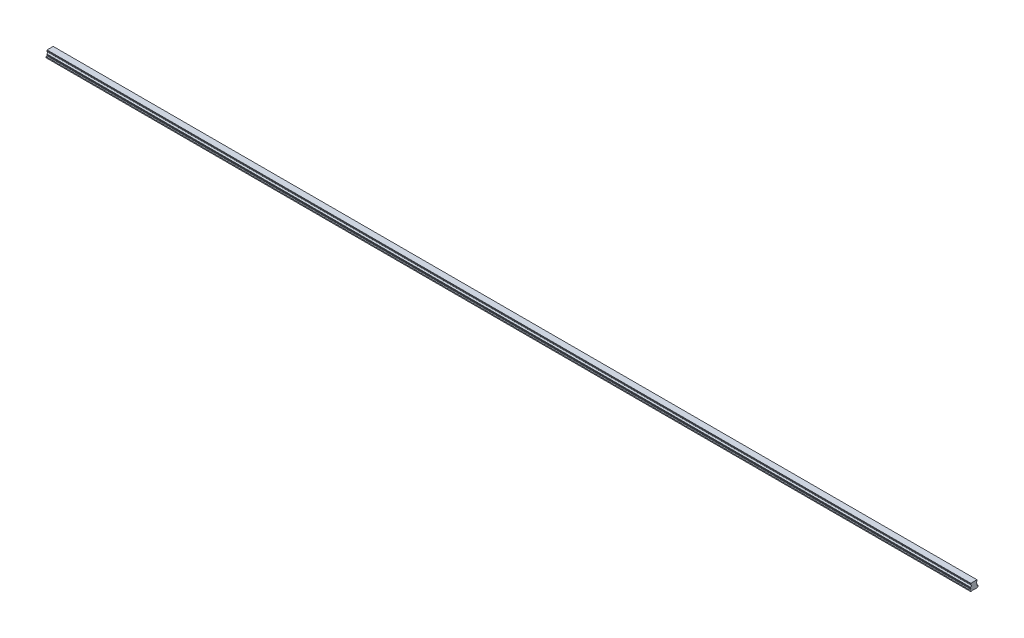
from build123d import *

# Parameters (mm, degrees)
BOSS_EXTRUDE1_DEPTH        = 2820
SKETCH3_R                  = 3
SKETCH3_R_2                = 2.5
CUT_EXTRUDE3_DEPTH         = 12
SKETCH3_2_R                = 2.5
CUT_EXTRUDE4_DEPTH         = 15
CHAMFER1_SIZE              = 0.5
LPATTERN4_COUNT            = 47
LPATTERN4_PITCH            = 60
CHAMFER1_OF_LPATTERN4_SIZE = 0.5


with BuildPart() as part:
    # Sketch1 → Boss-Extrude1 (new body)
    with BuildSketch(Plane(origin=(0, 0, 0), x_dir=(0, 0, -1), z_dir=(1, 0, 0))):
        with BuildLine():
            Line((9.375, 21.8), (-9.375, 21.8))
            Line((-9.375, 21.8), (-9.375, 20.756))
            Line((-9.375, 20.756), (-10, 19.415683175))
            Line((-10, 19.415683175), (-10, 17.685449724))
            ThreePointArc((-10, 17.685449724), (-7.2, 14.6), (-10, 11.514550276))
            Line((-10, 11.514550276), (-10, 9.784316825))
            Line((-10, 9.784316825), (-9.375, 8.444))
            Line((-9.375, 8.444), (-9.922688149, 6.4))
            Line((-9.922688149, 6.4), (-12.5, 5.489338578))
            Line((-12.5, 5.489338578), (-12.5, 2.65))
            Line((-12.5, 2.65), (-9.85, 0))
            Line((-9.85, 0), (-5.5, 0))
            Line((-5.5, 0), (-5, 0.5))
            Line((-5, 0.5), (5, 0.5))
            Line((5, 0.5), (5.5, 0))
            Line((5.5, 0), (9.85, 0))
            Line((9.85, 0), (12.5, 2.65))
            Line((12.5, 2.65), (12.5, 5.489338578))
            Line((12.5, 5.489338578), (9.922688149, 6.4))
            Line((9.922688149, 6.4), (9.375, 8.444))
            Line((9.375, 8.444), (10, 9.784316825))
            Line((10, 9.784316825), (10, 11.514550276))
            ThreePointArc((10, 11.514550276), (7.2, 14.6), (10, 17.685449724))
            Line((10, 17.685449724), (10, 19.415683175))
            Line((10, 19.415683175), (9.375, 20.756))
            Line((9.375, 20.756), (9.375, 21.8))
        make_face()
    extrude(amount=BOSS_EXTRUDE1_DEPTH)

    # Sketch3 → Cut-Extrude3 (cut)
    with BuildSketch(Plane.XZ):
        with Locations(Location((30, 0, 0), (0, 0, 270))):
            Circle(SKETCH3_R)
        with Locations(Location((30, 0, 0), (0, 0, 270))):
            Circle(SKETCH3_R_2, mode=Mode.SUBTRACT)
    cut_extrude3 = extrude(amount=-CUT_EXTRUDE3_DEPTH, mode=Mode.SUBTRACT)

    # Sketch3_2 → Cut-Extrude4 (cut)
    with BuildSketch(Plane.XZ):
        with Locations(Location((30, 0, 0), (0, 0, 270))):
            Circle(SKETCH3_2_R)
    cut_extrude4 = extrude(amount=-CUT_EXTRUDE4_DEPTH, mode=Mode.SUBTRACT)

    # Cut-Extrude5 cone 1 section (on through the dimple's axis) → Cut-Extrude5 (revolve, cut)
    with BuildSketch(Plane(origin=(30, 15, 0), x_dir=(0, 0, -1), z_dir=(1, 0, 0))):
        Polygon((0, 0), (2.5, 0), (0, 1.443375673), align=None)
    cut_extrude5 = revolve(axis=Axis((30, 15, 0), (0, 1, 0)), mode=Mode.SUBTRACT)

    # Chamfer1
    chamfer1_edges = [part.edges().sort_by_distance(p)[0] for p in [
        (30, 0.5, 3),
    ]]
    chamfer(chamfer1_edges, length=CHAMFER1_SIZE)

    # LPattern4: Cut-Extrude3, Cut-Extrude4, Cut-Extrude5 ×47
    with Locations(*[(i * LPATTERN4_PITCH, 0, 0) for i in range(1, LPATTERN4_COUNT)]):
        add(cut_extrude3, mode=Mode.SUBTRACT)
        add(cut_extrude4, mode=Mode.SUBTRACT)
        add(cut_extrude5, mode=Mode.SUBTRACT)

    # Chamfer1 of LPattern4
    chamfer1_of_lpattern4_edges = [part.edges().sort_by_distance(p)[0] for p in [
        (90, 0.5, 3),
        (150, 0.5, 3),
        (210, 0.5, 3),
        (270, 0.5, 3),
        (330, 0.5, 3),
        (390, 0.5, 3),
        (450, 0.5, 3),
        (510, 0.5, 3),
        (570, 0.5, 3),
        (630, 0.5, 3),
        (690, 0.5, 3),
        (750, 0.5, 3),
        (810, 0.5, 3),
        (870, 0.5, 3),
        (930, 0.5, 3),
        (990, 0.5, 3),
        (1050, 0.5, 3),
        (1110, 0.5, 3),
        (1170, 0.5, 3),
        (1230, 0.5, 3),
        (1290, 0.5, 3),
        (1350, 0.5, 3),
        (1410, 0.5, 3),
        (1470, 0.5, 3),
        (1530, 0.5, 3),
        (1590, 0.5, 3),
        (1650, 0.5, 3),
        (1710, 0.5, 3),
        (1770, 0.5, 3),
        (1830, 0.5, 3),
        (1890, 0.5, 3),
        (1950, 0.5, 3),
        (2010, 0.5, 3),
        (2070, 0.5, 3),
        (2130, 0.5, 3),
        (2190, 0.5, 3),
        (2250, 0.5, 3),
        (2310, 0.5, 3),
        (2370, 0.5, 3),
        (2430, 0.5, 3),
        (2490, 0.5, 3),
        (2550, 0.5, 3),
        (2610, 0.5, 3),
        (2670, 0.5, 3),
        (2730, 0.5, 3),
        (2790, 0.5, 3),
    ]]
    chamfer(chamfer1_of_lpattern4_edges, length=CHAMFER1_OF_LPATTERN4_SIZE)


solid = part.part
